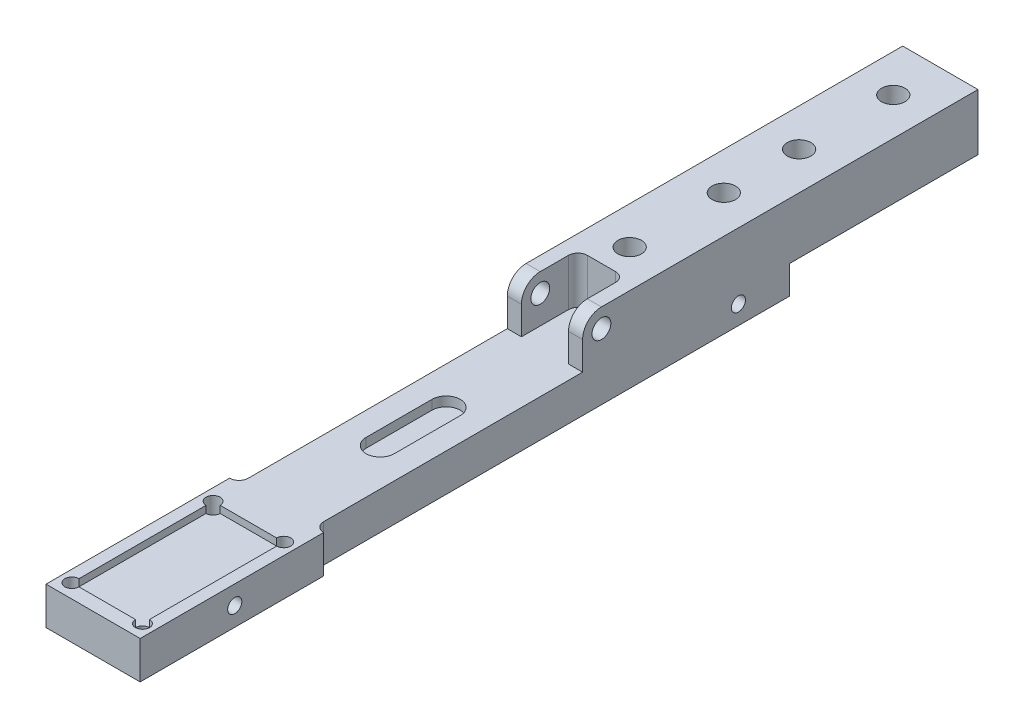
ISO-10303-21;
HEADER;
FILE_DESCRIPTION(('STEP AP214'),'2;1');
FILE_NAME('part.step','',(''),(''),'','','');
FILE_SCHEMA(('AUTOMOTIVE_DESIGN { 1 0 10303 214 1 1 1 1 }'));
ENDSEC;
DATA;
#1=APPLICATION_CONTEXT('core data for automotive mechanical design processes');
#2=APPLICATION_PROTOCOL_DEFINITION('international standard','automotive_design',2000,#1);
#3=PRODUCT_CONTEXT('',#1,'mechanical');
#4=PRODUCT('Part','Part','',(#3));
#5=PRODUCT_RELATED_PRODUCT_CATEGORY('part','',(#4));
#6=PRODUCT_DEFINITION_FORMATION('','',#4);
#7=PRODUCT_DEFINITION_CONTEXT('part definition',#1,'design');
#8=PRODUCT_DEFINITION('design','',#6,#7);
#9=PRODUCT_DEFINITION_SHAPE('','',#8);
#10=(LENGTH_UNIT() NAMED_UNIT(*) SI_UNIT(.MILLI.,.METRE.));
#11=(NAMED_UNIT(*) PLANE_ANGLE_UNIT() SI_UNIT($,.RADIAN.));
#12=(NAMED_UNIT(*) SI_UNIT($,.STERADIAN.) SOLID_ANGLE_UNIT());
#13=UNCERTAINTY_MEASURE_WITH_UNIT(LENGTH_MEASURE(1.E-05),#10,'distance_accuracy_value','');
#14=(GEOMETRIC_REPRESENTATION_CONTEXT(3) GLOBAL_UNCERTAINTY_ASSIGNED_CONTEXT((#13)) GLOBAL_UNIT_ASSIGNED_CONTEXT((#10,
#11,#12)) REPRESENTATION_CONTEXT('',''));
#15=CARTESIAN_POINT('',(0.,0.,0.));
#16=DIRECTION('',(0.,0.,1.));
#17=DIRECTION('',(1.,0.,0.));
#18=AXIS2_PLACEMENT_3D('',#15,#16,#17);
#19=CARTESIAN_POINT('',(10.,-8.,-40.));
#20=DIRECTION('',(0.,0.,1.));
#21=DIRECTION('',(1.,0.,0.));
#22=AXIS2_PLACEMENT_3D('',#19,#20,#21);
#23=PLANE('',#22);
#24=DIRECTION('',(-1.,0.,0.));
#25=VECTOR('',#24,1.);
#26=CARTESIAN_POINT('',(-8.,-8.,-40.));
#27=LINE('',#26,#25);
#28=CARTESIAN_POINT('',(8.,-8.,-40.));
#29=VERTEX_POINT('',#28);
#30=CARTESIAN_POINT('',(-8.,-8.,-40.));
#31=VERTEX_POINT('',#30);
#32=EDGE_CURVE('E345',#29,#31,#27,.T.);
#33=ORIENTED_EDGE('',*,*,#32,.F.);
#34=DIRECTION('',(0.,-1.,0.));
#35=VECTOR('',#34,1.);
#36=CARTESIAN_POINT('',(8.,-8.,-40.));
#37=LINE('',#36,#35);
#38=CARTESIAN_POINT('',(8.,-14.,-40.));
#39=VERTEX_POINT('',#38);
#40=EDGE_CURVE('E365',#29,#39,#37,.T.);
#41=ORIENTED_EDGE('',*,*,#40,.T.);
#42=DIRECTION('',(-1.,0.,0.));
#43=VECTOR('',#42,1.);
#44=CARTESIAN_POINT('',(10.,-14.,-40.));
#45=LINE('',#44,#43);
#46=CARTESIAN_POINT('',(-8.,-14.,-40.));
#47=VERTEX_POINT('',#46);
#48=EDGE_CURVE('E501',#39,#47,#45,.T.);
#49=ORIENTED_EDGE('',*,*,#48,.T.);
#50=DIRECTION('',(0.,1.,0.));
#51=VECTOR('',#50,1.);
#52=CARTESIAN_POINT('',(-8.,-8.,-40.));
#53=LINE('',#52,#51);
#54=EDGE_CURVE('E448',#47,#31,#53,.T.);
#55=ORIENTED_EDGE('',*,*,#54,.T.);
#56=EDGE_LOOP('',(#33,#41,#49,#55));
#57=FACE_BOUND('',#56,.T.);
#58=ADVANCED_FACE('F35',(#57),#23,.F.);
#59=CARTESIAN_POINT('',(10.,-8.,4.));
#60=DIRECTION('',(0.,0.,-1.));
#61=DIRECTION('',(-1.,0.,0.));
#62=AXIS2_PLACEMENT_3D('',#59,#60,#61);
#63=PLANE('',#62);
#64=DIRECTION('',(-1.,0.,0.));
#65=VECTOR('',#64,1.);
#66=CARTESIAN_POINT('',(-8.,-6.,4.));
#67=LINE('',#66,#65);
#68=CARTESIAN_POINT('',(8.,-6.,4.));
#69=VERTEX_POINT('',#68);
#70=CARTESIAN_POINT('',(5.,-6.,4.));
#71=VERTEX_POINT('',#70);
#72=EDGE_CURVE('E546',#69,#71,#67,.T.);
#73=ORIENTED_EDGE('',*,*,#72,.F.);
#74=DIRECTION('',(0.,-1.,0.));
#75=VECTOR('',#74,1.);
#76=CARTESIAN_POINT('',(8.,-8.,4.));
#77=LINE('',#76,#75);
#78=CARTESIAN_POINT('',(8.,0.,4.));
#79=VERTEX_POINT('',#78);
#80=EDGE_CURVE('E461',#79,#69,#77,.T.);
#81=ORIENTED_EDGE('',*,*,#80,.F.);
#82=DIRECTION('',(-1.,0.,0.));
#83=VECTOR('',#82,1.);
#84=CARTESIAN_POINT('',(10.,0.,4.));
#85=LINE('',#84,#83);
#86=CARTESIAN_POINT('',(5.,0.,4.));
#87=VERTEX_POINT('',#86);
#88=EDGE_CURVE('E481',#79,#87,#85,.T.);
#89=ORIENTED_EDGE('',*,*,#88,.T.);
#90=DIRECTION('',(0.,1.,0.));
#91=VECTOR('',#90,1.);
#92=CARTESIAN_POINT('',(5.,-6.,4.));
#93=LINE('',#92,#91);
#94=EDGE_CURVE('E545',#71,#87,#93,.T.);
#95=ORIENTED_EDGE('',*,*,#94,.F.);
#96=EDGE_LOOP('',(#73,#81,#89,#95));
#97=FACE_BOUND('',#96,.T.);
#98=ADVANCED_FACE('F435',(#97),#63,.F.);
#99=CARTESIAN_POINT('',(-5.,-6.,4.));
#100=VERTEX_POINT('',#99);
#101=CARTESIAN_POINT('',(-8.,-6.,4.));
#102=VERTEX_POINT('',#101);
#103=EDGE_CURVE('E597',#100,#102,#67,.T.);
#104=ORIENTED_EDGE('',*,*,#103,.F.);
#105=DIRECTION('',(0.,1.,0.));
#106=VECTOR('',#105,1.);
#107=CARTESIAN_POINT('',(-5.,-6.,4.));
#108=LINE('',#107,#106);
#109=CARTESIAN_POINT('',(-5.,0.,4.));
#110=VERTEX_POINT('',#109);
#111=EDGE_CURVE('E553',#100,#110,#108,.T.);
#112=ORIENTED_EDGE('',*,*,#111,.T.);
#113=CARTESIAN_POINT('',(-8.,0.,4.));
#114=VERTEX_POINT('',#113);
#115=EDGE_CURVE('E535',#110,#114,#85,.T.);
#116=ORIENTED_EDGE('',*,*,#115,.T.);
#117=DIRECTION('',(0.,1.,0.));
#118=VECTOR('',#117,1.);
#119=CARTESIAN_POINT('',(-8.,-8.,4.));
#120=LINE('',#119,#118);
#121=EDGE_CURVE('E482',#102,#114,#120,.T.);
#122=ORIENTED_EDGE('',*,*,#121,.F.);
#123=EDGE_LOOP('',(#104,#112,#116,#122));
#124=FACE_BOUND('',#123,.T.);
#125=ADVANCED_FACE('F442',(#124),#63,.F.);
#126=CARTESIAN_POINT('',(10.,0.,0.));
#127=DIRECTION('',(-1.,0.,0.));
#128=DIRECTION('',(0.,0.,1.));
#129=AXIS2_PLACEMENT_3D('',#126,#127,#128);
#130=CYLINDRICAL_SURFACE('',#129,4.);
#131=ORIENTED_EDGE('',*,*,#115,.F.);
#132=CARTESIAN_POINT('',(-5.,0.,0.));
#133=DIRECTION('',(-1.,0.,0.));
#134=DIRECTION('',(0.,0.,1.));
#135=AXIS2_PLACEMENT_3D('',#132,#133,#134);
#136=CIRCLE('',#135,4.);
#137=CARTESIAN_POINT('',(-5.,4.,0.));
#138=VERTEX_POINT('',#137);
#139=EDGE_CURVE('E525',#110,#138,#136,.T.);
#140=ORIENTED_EDGE('',*,*,#139,.T.);
#141=DIRECTION('',(-1.,0.,0.));
#142=VECTOR('',#141,1.);
#143=CARTESIAN_POINT('',(10.,4.,0.));
#144=LINE('',#143,#142);
#145=CARTESIAN_POINT('',(-8.,4.,0.));
#146=VERTEX_POINT('',#145);
#147=EDGE_CURVE('E490',#138,#146,#144,.T.);
#148=ORIENTED_EDGE('',*,*,#147,.T.);
#149=CARTESIAN_POINT('',(-8.,0.,0.));
#150=DIRECTION('',(1.,0.,0.));
#151=DIRECTION('',(0.,0.,-1.));
#152=AXIS2_PLACEMENT_3D('',#149,#150,#151);
#153=CIRCLE('',#152,4.);
#154=EDGE_CURVE('E513',#146,#114,#153,.T.);
#155=ORIENTED_EDGE('',*,*,#154,.T.);
#156=EDGE_LOOP('',(#131,#140,#148,#155));
#157=FACE_BOUND('',#156,.T.);
#158=ADVANCED_FACE('F640',(#157),#130,.T.);
#159=CARTESIAN_POINT('',(10.,0.,0.));
#160=DIRECTION('',(-1.,0.,0.));
#161=DIRECTION('',(0.,0.,1.));
#162=AXIS2_PLACEMENT_3D('',#159,#160,#161);
#163=CYLINDRICAL_SURFACE('',#162,2.);
#164=CARTESIAN_POINT('',(-5.,0.,0.));
#165=DIRECTION('',(-1.,0.,0.));
#166=DIRECTION('',(0.,0.,1.));
#167=AXIS2_PLACEMENT_3D('',#164,#165,#166);
#168=CIRCLE('',#167,2.);
#169=CARTESIAN_POINT('',(-5.,0.,2.));
#170=VERTEX_POINT('',#169);
#171=EDGE_CURVE('E522',#170,#170,#168,.T.);
#172=ORIENTED_EDGE('',*,*,#171,.F.);
#173=EDGE_LOOP('',(#172));
#174=FACE_BOUND('',#173,.T.);
#175=CARTESIAN_POINT('',(-8.,0.,0.));
#176=DIRECTION('',(1.,0.,0.));
#177=DIRECTION('',(0.,0.,-1.));
#178=AXIS2_PLACEMENT_3D('',#175,#176,#177);
#179=CIRCLE('',#178,2.);
#180=CARTESIAN_POINT('',(-8.,0.,-2.));
#181=VERTEX_POINT('',#180);
#182=EDGE_CURVE('E510',#181,#181,#179,.T.);
#183=ORIENTED_EDGE('',*,*,#182,.F.);
#184=EDGE_LOOP('',(#183));
#185=FACE_BOUND('',#184,.T.);
#186=ADVANCED_FACE('F669',(#174,#185),#163,.F.);
#187=CARTESIAN_POINT('',(10.,-8.00000000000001,100.));
#188=DIRECTION('',(0.,0.,-1.));
#189=DIRECTION('',(-1.,0.,0.));
#190=AXIS2_PLACEMENT_3D('',#187,#188,#189);
#191=PLANE('',#190);
#192=DIRECTION('',(0.,-1.,0.));
#193=VECTOR('',#192,1.);
#194=CARTESIAN_POINT('',(-10.,-8.00000000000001,100.));
#195=LINE('',#194,#193);
#196=CARTESIAN_POINT('',(-10.,-6.,100.));
#197=VERTEX_POINT('',#196);
#198=CARTESIAN_POINT('',(-10.,-14.,100.));
#199=VERTEX_POINT('',#198);
#200=EDGE_CURVE('E489',#197,#199,#195,.T.);
#201=ORIENTED_EDGE('',*,*,#200,.T.);
#202=DIRECTION('',(-1.,0.,0.));
#203=VECTOR('',#202,1.);
#204=CARTESIAN_POINT('',(10.,-14.,100.));
#205=LINE('',#204,#203);
#206=CARTESIAN_POINT('',(10.,-14.,100.));
#207=VERTEX_POINT('',#206);
#208=EDGE_CURVE('E506',#207,#199,#205,.T.);
#209=ORIENTED_EDGE('',*,*,#208,.F.);
#210=DIRECTION('',(0.,-1.,0.));
#211=VECTOR('',#210,1.);
#212=CARTESIAN_POINT('',(10.,-8.00000000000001,100.));
#213=LINE('',#212,#211);
#214=CARTESIAN_POINT('',(10.,-6.,100.));
#215=VERTEX_POINT('',#214);
#216=EDGE_CURVE('E497',#215,#207,#213,.T.);
#217=ORIENTED_EDGE('',*,*,#216,.F.);
#218=DIRECTION('',(-1.,0.,0.));
#219=VECTOR('',#218,1.);
#220=CARTESIAN_POINT('',(-10.,-6.,100.));
#221=LINE('',#220,#219);
#222=EDGE_CURVE('E604',#215,#197,#221,.T.);
#223=ORIENTED_EDGE('',*,*,#222,.T.);
#224=EDGE_LOOP('',(#201,#209,#217,#223));
#225=FACE_BOUND('',#224,.T.);
#226=ADVANCED_FACE('F667',(#225),#191,.F.);
#227=CARTESIAN_POINT('',(10.,-14.,-40.));
#228=DIRECTION('',(0.,1.,0.));
#229=DIRECTION('',(0.,0.,1.));
#230=AXIS2_PLACEMENT_3D('',#227,#228,#229);
#231=PLANE('',#230);
#232=CARTESIAN_POINT('',(0.,-14.,-14.));
#233=DIRECTION('',(0.,-1.,0.));
#234=DIRECTION('',(0.,0.,-1.));
#235=AXIS2_PLACEMENT_3D('',#232,#233,#234);
#236=CIRCLE('',#235,2.5);
#237=CARTESIAN_POINT('',(0.,-14.,-16.5));
#238=VERTEX_POINT('',#237);
#239=EDGE_CURVE('E809',#238,#238,#236,.T.);
#240=ORIENTED_EDGE('',*,*,#239,.F.);
#241=EDGE_LOOP('',(#240));
#242=FACE_BOUND('',#241,.T.);
#243=CARTESIAN_POINT('',(0.,-14.,-34.));
#244=DIRECTION('',(0.,-1.,0.));
#245=DIRECTION('',(0.,0.,-1.));
#246=AXIS2_PLACEMENT_3D('',#243,#244,#245);
#247=CIRCLE('',#246,2.5);
#248=CARTESIAN_POINT('',(0.,-14.,-36.5));
#249=VERTEX_POINT('',#248);
#250=EDGE_CURVE('E269',#249,#249,#247,.T.);
#251=ORIENTED_EDGE('',*,*,#250,.F.);
#252=EDGE_LOOP('',(#251));
#253=FACE_BOUND('',#252,.T.);
#254=CARTESIAN_POINT('',(-7.5,-14.,96.9999999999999));
#255=DIRECTION('',(0.,1.,0.));
#256=DIRECTION('',(0.,0.,1.));
#257=AXIS2_PLACEMENT_3D('',#254,#255,#256);
#258=CIRCLE('',#257,1.5);
#259=CARTESIAN_POINT('',(-7.5,-14.,98.4999999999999));
#260=VERTEX_POINT('',#259);
#261=EDGE_CURVE('E324',#260,#260,#258,.T.);
#262=ORIENTED_EDGE('',*,*,#261,.T.);
#263=EDGE_LOOP('',(#262));
#264=FACE_BOUND('',#263,.T.);
#265=CARTESIAN_POINT('',(-7.49999999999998,-14.,67.));
#266=DIRECTION('',(0.,1.,0.));
#267=DIRECTION('',(0.,0.,1.));
#268=AXIS2_PLACEMENT_3D('',#265,#266,#267);
#269=CIRCLE('',#268,1.5);
#270=CARTESIAN_POINT('',(-7.49999999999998,-14.,68.5));
#271=VERTEX_POINT('',#270);
#272=EDGE_CURVE('E330',#271,#271,#269,.T.);
#273=ORIENTED_EDGE('',*,*,#272,.T.);
#274=EDGE_LOOP('',(#273));
#275=FACE_BOUND('',#274,.T.);
#276=CARTESIAN_POINT('',(7.5,-14.,67.));
#277=DIRECTION('',(0.,1.,0.));
#278=DIRECTION('',(0.,0.,1.));
#279=AXIS2_PLACEMENT_3D('',#276,#277,#278);
#280=CIRCLE('',#279,1.5);
#281=CARTESIAN_POINT('',(7.5,-14.,68.5));
#282=VERTEX_POINT('',#281);
#283=EDGE_CURVE('E336',#282,#282,#280,.T.);
#284=ORIENTED_EDGE('',*,*,#283,.T.);
#285=EDGE_LOOP('',(#284));
#286=FACE_BOUND('',#285,.T.);
#287=CARTESIAN_POINT('',(7.5,-14.,97.));
#288=DIRECTION('',(0.,1.,0.));
#289=DIRECTION('',(0.,0.,1.));
#290=AXIS2_PLACEMENT_3D('',#287,#288,#289);
#291=CIRCLE('',#290,1.5);
#292=CARTESIAN_POINT('',(7.5,-14.,98.5));
#293=VERTEX_POINT('',#292);
#294=EDGE_CURVE('E342',#293,#293,#291,.T.);
#295=ORIENTED_EDGE('',*,*,#294,.T.);
#296=EDGE_LOOP('',(#295));
#297=FACE_BOUND('',#296,.T.);
#298=CARTESIAN_POINT('',(-10.,-14.,59.));
#299=DIRECTION('',(0.,1.,0.));
#300=DIRECTION('',(0.,0.,1.));
#301=AXIS2_PLACEMENT_3D('',#298,#299,#300);
#302=CIRCLE('',#301,2.);
#303=CARTESIAN_POINT('',(-9.99999999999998,-14.,61.));
#304=VERTEX_POINT('',#303);
#305=CARTESIAN_POINT('',(-8.,-14.,59.));
#306=VERTEX_POINT('',#305);
#307=EDGE_CURVE('E359',#304,#306,#302,.T.);
#308=ORIENTED_EDGE('',*,*,#307,.T.);
#309=DIRECTION('',(0.,0.,-1.));
#310=VECTOR('',#309,1.);
#311=CARTESIAN_POINT('',(-8.,-14.,-40.));
#312=LINE('',#311,#310);
#313=EDGE_CURVE('E620',#306,#47,#312,.T.);
#314=ORIENTED_EDGE('',*,*,#313,.T.);
#315=ORIENTED_EDGE('',*,*,#48,.F.);
#316=DIRECTION('',(0.,0.,1.));
#317=VECTOR('',#316,1.);
#318=CARTESIAN_POINT('',(8.,-14.,-40.));
#319=LINE('',#318,#317);
#320=CARTESIAN_POINT('',(8.,-14.,59.));
#321=VERTEX_POINT('',#320);
#322=EDGE_CURVE('E458',#39,#321,#319,.T.);
#323=ORIENTED_EDGE('',*,*,#322,.T.);
#324=CARTESIAN_POINT('',(10.,-14.,59.));
#325=DIRECTION('',(0.,1.,0.));
#326=DIRECTION('',(0.,0.,1.));
#327=AXIS2_PLACEMENT_3D('',#324,#325,#326);
#328=CIRCLE('',#327,2.);
#329=CARTESIAN_POINT('',(10.,-14.,61.));
#330=VERTEX_POINT('',#329);
#331=EDGE_CURVE('E611',#321,#330,#328,.T.);
#332=ORIENTED_EDGE('',*,*,#331,.T.);
#333=DIRECTION('',(0.,0.,-1.));
#334=VECTOR('',#333,1.);
#335=CARTESIAN_POINT('',(10.,-14.,-40.));
#336=LINE('',#335,#334);
#337=EDGE_CURVE('E499',#207,#330,#336,.T.);
#338=ORIENTED_EDGE('',*,*,#337,.F.);
#339=ORIENTED_EDGE('',*,*,#208,.T.);
#340=DIRECTION('',(0.,0.,-1.));
#341=VECTOR('',#340,1.);
#342=CARTESIAN_POINT('',(-10.,-14.,-40.));
#343=LINE('',#342,#341);
#344=EDGE_CURVE('E492',#199,#304,#343,.T.);
#345=ORIENTED_EDGE('',*,*,#344,.T.);
#346=EDGE_LOOP('',(#308,#314,#315,#323,#332,#338,#339,#345));
#347=FACE_BOUND('',#346,.T.);
#348=ADVANCED_FACE('F626',(#242,#253,#264,#275,#286,#297,#347),#231,.F.);
#349=CARTESIAN_POINT('',(10.,0.,0.));
#350=DIRECTION('',(-1.,0.,0.));
#351=DIRECTION('',(0.,0.,1.));
#352=AXIS2_PLACEMENT_3D('',#349,#350,#351);
#353=PLANE('',#352);
#354=CARTESIAN_POINT('',(10.,-10.,79.9));
#355=DIRECTION('',(1.,0.,0.));
#356=DIRECTION('',(0.,0.,-1.));
#357=AXIS2_PLACEMENT_3D('',#354,#355,#356);
#358=CIRCLE('',#357,1.5);
#359=CARTESIAN_POINT('',(10.,-10.,78.4));
#360=VERTEX_POINT('',#359);
#361=EDGE_CURVE('E789',#360,#360,#358,.T.);
#362=ORIENTED_EDGE('',*,*,#361,.F.);
#363=EDGE_LOOP('',(#362));
#364=FACE_BOUND('',#363,.T.);
#365=ORIENTED_EDGE('',*,*,#337,.T.);
#366=DIRECTION('',(0.,1.,0.));
#367=VECTOR('',#366,1.);
#368=CARTESIAN_POINT('',(10.,-14.,61.));
#369=LINE('',#368,#367);
#370=CARTESIAN_POINT('',(10.,-5.99999999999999,61.));
#371=VERTEX_POINT('',#370);
#372=EDGE_CURVE('E607',#330,#371,#369,.T.);
#373=ORIENTED_EDGE('',*,*,#372,.T.);
#374=DIRECTION('',(0.,0.,-1.));
#375=VECTOR('',#374,1.);
#376=CARTESIAN_POINT('',(10.,-6.,100.));
#377=LINE('',#376,#375);
#378=EDGE_CURVE('E598',#215,#371,#377,.T.);
#379=ORIENTED_EDGE('',*,*,#378,.F.);
#380=ORIENTED_EDGE('',*,*,#216,.T.);
#381=EDGE_LOOP('',(#365,#373,#379,#380));
#382=FACE_BOUND('',#381,.T.);
#383=ADVANCED_FACE('F663',(#364,#382),#353,.F.);
#384=CARTESIAN_POINT('',(-10.,0.,0.));
#385=DIRECTION('',(-1.,0.,0.));
#386=DIRECTION('',(0.,0.,1.));
#387=AXIS2_PLACEMENT_3D('',#384,#385,#386);
#388=PLANE('',#387);
#389=DIRECTION('',(0.,1.,0.));
#390=VECTOR('',#389,1.);
#391=CARTESIAN_POINT('',(-9.99999999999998,-14.,61.));
#392=LINE('',#391,#390);
#393=CARTESIAN_POINT('',(-9.99999999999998,-6.,61.));
#394=VERTEX_POINT('',#393);
#395=EDGE_CURVE('E618',#304,#394,#392,.T.);
#396=ORIENTED_EDGE('',*,*,#395,.F.);
#397=ORIENTED_EDGE('',*,*,#344,.F.);
#398=ORIENTED_EDGE('',*,*,#200,.F.);
#399=DIRECTION('',(0.,0.,-1.));
#400=VECTOR('',#399,1.);
#401=CARTESIAN_POINT('',(-10.,-6.,100.));
#402=LINE('',#401,#400);
#403=EDGE_CURVE('E601',#197,#394,#402,.T.);
#404=ORIENTED_EDGE('',*,*,#403,.T.);
#405=EDGE_LOOP('',(#396,#397,#398,#404));
#406=FACE_BOUND('',#405,.T.);
#407=ADVANCED_FACE('F633',(#406),#388,.T.);
#408=CARTESIAN_POINT('',(10.,4.,0.));
#409=DIRECTION('',(0.,-1.,0.));
#410=DIRECTION('',(0.,0.,-1.));
#411=AXIS2_PLACEMENT_3D('',#408,#409,#410);
#412=PLANE('',#411);
#413=CARTESIAN_POINT('',(0.,4.00000000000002,-50.));
#414=DIRECTION('',(0.,-1.,0.));
#415=DIRECTION('',(1.,0.,0.));
#416=AXIS2_PLACEMENT_3D('',#413,#414,#415);
#417=CIRCLE('',#416,2.5);
#418=CARTESIAN_POINT('',(2.50000000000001,4.00000000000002,-50.));
#419=VERTEX_POINT('',#418);
#420=EDGE_CURVE('E800',#419,#419,#417,.T.);
#421=ORIENTED_EDGE('',*,*,#420,.T.);
#422=EDGE_LOOP('',(#421));
#423=FACE_BOUND('',#422,.T.);
#424=CARTESIAN_POINT('',(0.,4.00000000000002,-70.));
#425=DIRECTION('',(0.,-1.,0.));
#426=DIRECTION('',(1.,0.,0.));
#427=AXIS2_PLACEMENT_3D('',#424,#425,#426);
#428=CIRCLE('',#427,2.5);
#429=CARTESIAN_POINT('',(2.50000000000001,4.00000000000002,-70.));
#430=VERTEX_POINT('',#429);
#431=EDGE_CURVE('E806',#430,#430,#428,.T.);
#432=ORIENTED_EDGE('',*,*,#431,.T.);
#433=EDGE_LOOP('',(#432));
#434=FACE_BOUND('',#433,.T.);
#435=CARTESIAN_POINT('',(0.,4.00000000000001,-14.));
#436=DIRECTION('',(0.,-1.,0.));
#437=DIRECTION('',(0.,0.,-1.));
#438=AXIS2_PLACEMENT_3D('',#435,#436,#437);
#439=CIRCLE('',#438,2.5);
#440=CARTESIAN_POINT('',(0.,4.00000000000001,-16.5));
#441=VERTEX_POINT('',#440);
#442=EDGE_CURVE('E812',#441,#441,#439,.T.);
#443=ORIENTED_EDGE('',*,*,#442,.T.);
#444=EDGE_LOOP('',(#443));
#445=FACE_BOUND('',#444,.T.);
#446=CARTESIAN_POINT('',(0.,4.00000000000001,-34.));
#447=DIRECTION('',(0.,-1.,0.));
#448=DIRECTION('',(0.,0.,-1.));
#449=AXIS2_PLACEMENT_3D('',#446,#447,#448);
#450=CIRCLE('',#449,2.5);
#451=CARTESIAN_POINT('',(0.,4.00000000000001,-36.5));
#452=VERTEX_POINT('',#451);
#453=EDGE_CURVE('E276',#452,#452,#450,.T.);
#454=ORIENTED_EDGE('',*,*,#453,.T.);
#455=EDGE_LOOP('',(#454));
#456=FACE_BOUND('',#455,.T.);
#457=ORIENTED_EDGE('',*,*,#147,.F.);
#458=DIRECTION('',(0.,0.,1.));
#459=VECTOR('',#458,1.);
#460=CARTESIAN_POINT('',(-5.,4.,4.));
#461=LINE('',#460,#459);
#462=CARTESIAN_POINT('',(-5.,4.,-6.));
#463=VERTEX_POINT('',#462);
#464=EDGE_CURVE('E576',#463,#138,#461,.T.);
#465=ORIENTED_EDGE('',*,*,#464,.F.);
#466=CARTESIAN_POINT('',(-3.,4.,-6.));
#467=DIRECTION('',(0.,1.,0.));
#468=DIRECTION('',(0.,0.,-1.));
#469=AXIS2_PLACEMENT_3D('',#466,#467,#468);
#470=CIRCLE('',#469,2.);
#471=CARTESIAN_POINT('',(-3.,4.,-8.));
#472=VERTEX_POINT('',#471);
#473=EDGE_CURVE('E565',#472,#463,#470,.T.);
#474=ORIENTED_EDGE('',*,*,#473,.F.);
#475=DIRECTION('',(-1.,0.,0.));
#476=VECTOR('',#475,1.);
#477=CARTESIAN_POINT('',(-3.,4.,-8.));
#478=LINE('',#477,#476);
#479=CARTESIAN_POINT('',(3.,4.,-8.));
#480=VERTEX_POINT('',#479);
#481=EDGE_CURVE('E569',#480,#472,#478,.T.);
#482=ORIENTED_EDGE('',*,*,#481,.F.);
#483=CARTESIAN_POINT('',(3.,4.,-6.));
#484=DIRECTION('',(0.,1.,0.));
#485=DIRECTION('',(0.,0.,1.));
#486=AXIS2_PLACEMENT_3D('',#483,#484,#485);
#487=CIRCLE('',#486,2.);
#488=CARTESIAN_POINT('',(5.,4.,-6.));
#489=VERTEX_POINT('',#488);
#490=EDGE_CURVE('E572',#489,#480,#487,.T.);
#491=ORIENTED_EDGE('',*,*,#490,.F.);
#492=DIRECTION('',(0.,0.,-1.));
#493=VECTOR('',#492,1.);
#494=CARTESIAN_POINT('',(5.,4.,4.));
#495=LINE('',#494,#493);
#496=CARTESIAN_POINT('',(5.,4.,0.));
#497=VERTEX_POINT('',#496);
#498=EDGE_CURVE('E488',#497,#489,#495,.T.);
#499=ORIENTED_EDGE('',*,*,#498,.F.);
#500=CARTESIAN_POINT('',(8.,4.,0.));
#501=VERTEX_POINT('',#500);
#502=EDGE_CURVE('E479',#501,#497,#144,.T.);
#503=ORIENTED_EDGE('',*,*,#502,.F.);
#504=DIRECTION('',(0.,0.,1.));
#505=VECTOR('',#504,1.);
#506=CARTESIAN_POINT('',(8.,4.,-40.));
#507=LINE('',#506,#505);
#508=CARTESIAN_POINT('',(8.,4.,-80.));
#509=VERTEX_POINT('',#508);
#510=EDGE_CURVE('E460',#509,#501,#507,.T.);
#511=ORIENTED_EDGE('',*,*,#510,.F.);
#512=DIRECTION('',(1.,0.,0.));
#513=VECTOR('',#512,1.);
#514=CARTESIAN_POINT('',(-8.,4.,-80.));
#515=LINE('',#514,#513);
#516=CARTESIAN_POINT('',(-8.,4.,-80.));
#517=VERTEX_POINT('',#516);
#518=EDGE_CURVE('E349',#517,#509,#515,.T.);
#519=ORIENTED_EDGE('',*,*,#518,.F.);
#520=DIRECTION('',(0.,0.,1.));
#521=VECTOR('',#520,1.);
#522=CARTESIAN_POINT('',(-8.,4.,-40.));
#523=LINE('',#522,#521);
#524=EDGE_CURVE('E514',#517,#146,#523,.T.);
#525=ORIENTED_EDGE('',*,*,#524,.T.);
#526=EDGE_LOOP('',(#457,#465,#474,#482,#491,#499,#503,#511,#519,#525));
#527=FACE_BOUND('',#526,.T.);
#528=ADVANCED_FACE('F486',(#423,#434,#445,#456,#527),#412,.F.);
#529=ORIENTED_EDGE('',*,*,#502,.T.);
#530=CARTESIAN_POINT('',(5.,0.,0.));
#531=DIRECTION('',(1.,0.,0.));
#532=DIRECTION('',(0.,0.,-1.));
#533=AXIS2_PLACEMENT_3D('',#530,#531,#532);
#534=CIRCLE('',#533,4.);
#535=EDGE_CURVE('E520',#497,#87,#534,.T.);
#536=ORIENTED_EDGE('',*,*,#535,.T.);
#537=ORIENTED_EDGE('',*,*,#88,.F.);
#538=CARTESIAN_POINT('',(8.,0.,0.));
#539=DIRECTION('',(-1.,0.,0.));
#540=DIRECTION('',(0.,0.,1.));
#541=AXIS2_PLACEMENT_3D('',#538,#539,#540);
#542=CIRCLE('',#541,4.);
#543=EDGE_CURVE('E468',#79,#501,#542,.T.);
#544=ORIENTED_EDGE('',*,*,#543,.T.);
#545=EDGE_LOOP('',(#529,#536,#537,#544));
#546=FACE_BOUND('',#545,.T.);
#547=ADVANCED_FACE('F477',(#546),#130,.T.);
#548=CARTESIAN_POINT('',(5.,0.,0.));
#549=DIRECTION('',(1.,0.,0.));
#550=DIRECTION('',(0.,0.,-1.));
#551=AXIS2_PLACEMENT_3D('',#548,#549,#550);
#552=CIRCLE('',#551,2.);
#553=CARTESIAN_POINT('',(5.,0.,-2.));
#554=VERTEX_POINT('',#553);
#555=EDGE_CURVE('E517',#554,#554,#552,.T.);
#556=ORIENTED_EDGE('',*,*,#555,.F.);
#557=EDGE_LOOP('',(#556));
#558=FACE_BOUND('',#557,.T.);
#559=CARTESIAN_POINT('',(8.,0.,0.));
#560=DIRECTION('',(-1.,0.,0.));
#561=DIRECTION('',(0.,0.,1.));
#562=AXIS2_PLACEMENT_3D('',#559,#560,#561);
#563=CIRCLE('',#562,2.);
#564=CARTESIAN_POINT('',(8.,0.,2.));
#565=VERTEX_POINT('',#564);
#566=EDGE_CURVE('E472',#565,#565,#563,.T.);
#567=ORIENTED_EDGE('',*,*,#566,.F.);
#568=EDGE_LOOP('',(#567));
#569=FACE_BOUND('',#568,.T.);
#570=ADVANCED_FACE('F680',(#558,#569),#163,.F.);
#571=CARTESIAN_POINT('',(-8.,-8.,-40.));
#572=DIRECTION('',(1.,0.,0.));
#573=DIRECTION('',(0.,0.,-1.));
#574=AXIS2_PLACEMENT_3D('',#571,#572,#573);
#575=PLANE('',#574);
#576=ORIENTED_EDGE('',*,*,#182,.T.);
#577=EDGE_LOOP('',(#576));
#578=FACE_BOUND('',#577,.T.);
#579=ORIENTED_EDGE('',*,*,#524,.F.);
#580=DIRECTION('',(0.,1.,0.));
#581=VECTOR('',#580,1.);
#582=CARTESIAN_POINT('',(-8.,4.,-80.));
#583=LINE('',#582,#581);
#584=CARTESIAN_POINT('',(-8.,-8.,-80.));
#585=VERTEX_POINT('',#584);
#586=EDGE_CURVE('E346',#585,#517,#583,.T.);
#587=ORIENTED_EDGE('',*,*,#586,.F.);
#588=DIRECTION('',(0.,0.,1.));
#589=VECTOR('',#588,1.);
#590=CARTESIAN_POINT('',(-8.,-8.,-80.));
#591=LINE('',#590,#589);
#592=EDGE_CURVE('E356',#585,#31,#591,.T.);
#593=ORIENTED_EDGE('',*,*,#592,.T.);
#594=ORIENTED_EDGE('',*,*,#54,.F.);
#595=ORIENTED_EDGE('',*,*,#313,.F.);
#596=DIRECTION('',(0.,1.,0.));
#597=VECTOR('',#596,1.);
#598=CARTESIAN_POINT('',(-8.,-14.,59.));
#599=LINE('',#598,#597);
#600=CARTESIAN_POINT('',(-8.,-5.99999999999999,59.));
#601=VERTEX_POINT('',#600);
#602=EDGE_CURVE('E617',#306,#601,#599,.T.);
#603=ORIENTED_EDGE('',*,*,#602,.T.);
#604=DIRECTION('',(0.,0.,-1.));
#605=VECTOR('',#604,1.);
#606=CARTESIAN_POINT('',(-8.,-6.,19.));
#607=LINE('',#606,#605);
#608=EDGE_CURVE('E593',#601,#102,#607,.T.);
#609=ORIENTED_EDGE('',*,*,#608,.T.);
#610=ORIENTED_EDGE('',*,*,#121,.T.);
#611=ORIENTED_EDGE('',*,*,#154,.F.);
#612=EDGE_LOOP('',(#579,#587,#593,#594,#595,#603,#609,#610,#611));
#613=FACE_BOUND('',#612,.T.);
#614=ADVANCED_FACE('F637',(#578,#613),#575,.F.);
#615=CARTESIAN_POINT('',(8.,-8.,-40.));
#616=DIRECTION('',(-1.,0.,0.));
#617=DIRECTION('',(0.,0.,1.));
#618=AXIS2_PLACEMENT_3D('',#615,#616,#617);
#619=PLANE('',#618);
#620=CARTESIAN_POINT('',(8.,-10.,-29.1));
#621=DIRECTION('',(1.,0.,0.));
#622=DIRECTION('',(0.,0.,-1.));
#623=AXIS2_PLACEMENT_3D('',#620,#621,#622);
#624=CIRCLE('',#623,1.5);
#625=CARTESIAN_POINT('',(8.,-10.,-30.6));
#626=VERTEX_POINT('',#625);
#627=EDGE_CURVE('E788',#626,#626,#624,.T.);
#628=ORIENTED_EDGE('',*,*,#627,.F.);
#629=EDGE_LOOP('',(#628));
#630=FACE_BOUND('',#629,.T.);
#631=ORIENTED_EDGE('',*,*,#566,.T.);
#632=EDGE_LOOP('',(#631));
#633=FACE_BOUND('',#632,.T.);
#634=ORIENTED_EDGE('',*,*,#80,.T.);
#635=DIRECTION('',(0.,0.,-1.));
#636=VECTOR('',#635,1.);
#637=CARTESIAN_POINT('',(8.,-6.,19.));
#638=LINE('',#637,#636);
#639=CARTESIAN_POINT('',(8.,-6.,59.));
#640=VERTEX_POINT('',#639);
#641=EDGE_CURVE('E578',#640,#69,#638,.T.);
#642=ORIENTED_EDGE('',*,*,#641,.F.);
#643=DIRECTION('',(0.,1.,0.));
#644=VECTOR('',#643,1.);
#645=CARTESIAN_POINT('',(8.,-14.,59.));
#646=LINE('',#645,#644);
#647=EDGE_CURVE('E608',#321,#640,#646,.T.);
#648=ORIENTED_EDGE('',*,*,#647,.F.);
#649=ORIENTED_EDGE('',*,*,#322,.F.);
#650=ORIENTED_EDGE('',*,*,#40,.F.);
#651=DIRECTION('',(0.,0.,1.));
#652=VECTOR('',#651,1.);
#653=CARTESIAN_POINT('',(8.,-8.,-80.));
#654=LINE('',#653,#652);
#655=CARTESIAN_POINT('',(8.,-8.,-80.));
#656=VERTEX_POINT('',#655);
#657=EDGE_CURVE('E370',#656,#29,#654,.T.);
#658=ORIENTED_EDGE('',*,*,#657,.F.);
#659=DIRECTION('',(0.,-1.,0.));
#660=VECTOR('',#659,1.);
#661=CARTESIAN_POINT('',(8.,4.,-80.));
#662=LINE('',#661,#660);
#663=EDGE_CURVE('E352',#509,#656,#662,.T.);
#664=ORIENTED_EDGE('',*,*,#663,.F.);
#665=ORIENTED_EDGE('',*,*,#510,.T.);
#666=ORIENTED_EDGE('',*,*,#543,.F.);
#667=EDGE_LOOP('',(#634,#642,#648,#649,#650,#658,#664,#665,#666));
#668=FACE_BOUND('',#667,.T.);
#669=ADVANCED_FACE('F454',(#630,#633,#668),#619,.F.);
#670=CARTESIAN_POINT('',(-5.,-6.,4.));
#671=DIRECTION('',(-1.,0.,0.));
#672=DIRECTION('',(0.,0.,1.));
#673=AXIS2_PLACEMENT_3D('',#670,#671,#672);
#674=PLANE('',#673);
#675=ORIENTED_EDGE('',*,*,#171,.T.);
#676=EDGE_LOOP('',(#675));
#677=FACE_BOUND('',#676,.T.);
#678=ORIENTED_EDGE('',*,*,#111,.F.);
#679=DIRECTION('',(0.,0.,1.));
#680=VECTOR('',#679,1.);
#681=CARTESIAN_POINT('',(-5.,-6.,4.));
#682=LINE('',#681,#680);
#683=CARTESIAN_POINT('',(-5.,-6.,-6.));
#684=VERTEX_POINT('',#683);
#685=EDGE_CURVE('E568',#684,#100,#682,.T.);
#686=ORIENTED_EDGE('',*,*,#685,.F.);
#687=DIRECTION('',(0.,1.,0.));
#688=VECTOR('',#687,1.);
#689=CARTESIAN_POINT('',(-5.,-6.,-6.));
#690=LINE('',#689,#688);
#691=EDGE_CURVE('E521',#684,#463,#690,.T.);
#692=ORIENTED_EDGE('',*,*,#691,.T.);
#693=ORIENTED_EDGE('',*,*,#464,.T.);
#694=ORIENTED_EDGE('',*,*,#139,.F.);
#695=EDGE_LOOP('',(#678,#686,#692,#693,#694));
#696=FACE_BOUND('',#695,.T.);
#697=ADVANCED_FACE('F643',(#677,#696),#674,.F.);
#698=CARTESIAN_POINT('',(5.,-6.,4.));
#699=DIRECTION('',(1.,0.,0.));
#700=DIRECTION('',(0.,0.,-1.));
#701=AXIS2_PLACEMENT_3D('',#698,#699,#700);
#702=PLANE('',#701);
#703=ORIENTED_EDGE('',*,*,#555,.T.);
#704=EDGE_LOOP('',(#703));
#705=FACE_BOUND('',#704,.T.);
#706=ORIENTED_EDGE('',*,*,#498,.T.);
#707=DIRECTION('',(0.,1.,0.));
#708=VECTOR('',#707,1.);
#709=CARTESIAN_POINT('',(5.,-6.,-6.));
#710=LINE('',#709,#708);
#711=CARTESIAN_POINT('',(5.,-6.,-6.));
#712=VERTEX_POINT('',#711);
#713=EDGE_CURVE('E557',#712,#489,#710,.T.);
#714=ORIENTED_EDGE('',*,*,#713,.F.);
#715=DIRECTION('',(0.,0.,-1.));
#716=VECTOR('',#715,1.);
#717=CARTESIAN_POINT('',(5.,-6.,4.));
#718=LINE('',#717,#716);
#719=EDGE_CURVE('E587',#71,#712,#718,.T.);
#720=ORIENTED_EDGE('',*,*,#719,.F.);
#721=ORIENTED_EDGE('',*,*,#94,.T.);
#722=ORIENTED_EDGE('',*,*,#535,.F.);
#723=EDGE_LOOP('',(#706,#714,#720,#721,#722));
#724=FACE_BOUND('',#723,.T.);
#725=ADVANCED_FACE('F657',(#705,#724),#702,.F.);
#726=CARTESIAN_POINT('',(-3.,-6.,-6.));
#727=DIRECTION('',(0.,1.,0.));
#728=DIRECTION('',(0.,0.,1.));
#729=AXIS2_PLACEMENT_3D('',#726,#727,#728);
#730=CYLINDRICAL_SURFACE('',#729,2.);
#731=ORIENTED_EDGE('',*,*,#473,.T.);
#732=ORIENTED_EDGE('',*,*,#691,.F.);
#733=CARTESIAN_POINT('',(-3.,-6.,-6.));
#734=DIRECTION('',(0.,1.,0.));
#735=DIRECTION('',(0.,0.,-1.));
#736=AXIS2_PLACEMENT_3D('',#733,#734,#735);
#737=CIRCLE('',#736,2.);
#738=CARTESIAN_POINT('',(-3.,-6.,-8.));
#739=VERTEX_POINT('',#738);
#740=EDGE_CURVE('E555',#739,#684,#737,.T.);
#741=ORIENTED_EDGE('',*,*,#740,.F.);
#742=DIRECTION('',(0.,1.,0.));
#743=VECTOR('',#742,1.);
#744=CARTESIAN_POINT('',(-3.,-6.,-8.));
#745=LINE('',#744,#743);
#746=EDGE_CURVE('E562',#739,#472,#745,.T.);
#747=ORIENTED_EDGE('',*,*,#746,.T.);
#748=EDGE_LOOP('',(#731,#732,#741,#747));
#749=FACE_BOUND('',#748,.T.);
#750=ADVANCED_FACE('F647',(#749),#730,.F.);
#751=CARTESIAN_POINT('',(-3.,-6.,-8.));
#752=DIRECTION('',(0.,0.,-1.));
#753=DIRECTION('',(0.,1.,0.));
#754=AXIS2_PLACEMENT_3D('',#751,#752,#753);
#755=PLANE('',#754);
#756=ORIENTED_EDGE('',*,*,#481,.T.);
#757=ORIENTED_EDGE('',*,*,#746,.F.);
#758=DIRECTION('',(-1.,0.,0.));
#759=VECTOR('',#758,1.);
#760=CARTESIAN_POINT('',(-3.,-6.,-8.));
#761=LINE('',#760,#759);
#762=CARTESIAN_POINT('',(3.,-6.,-8.));
#763=VERTEX_POINT('',#762);
#764=EDGE_CURVE('E581',#763,#739,#761,.T.);
#765=ORIENTED_EDGE('',*,*,#764,.F.);
#766=DIRECTION('',(0.,1.,0.));
#767=VECTOR('',#766,1.);
#768=CARTESIAN_POINT('',(3.,-6.,-8.));
#769=LINE('',#768,#767);
#770=EDGE_CURVE('E560',#763,#480,#769,.T.);
#771=ORIENTED_EDGE('',*,*,#770,.T.);
#772=EDGE_LOOP('',(#756,#757,#765,#771));
#773=FACE_BOUND('',#772,.T.);
#774=ADVANCED_FACE('F650',(#773),#755,.F.);
#775=CARTESIAN_POINT('',(3.,-6.,-6.));
#776=DIRECTION('',(0.,1.,0.));
#777=DIRECTION('',(0.,0.,1.));
#778=AXIS2_PLACEMENT_3D('',#775,#776,#777);
#779=CYLINDRICAL_SURFACE('',#778,2.);
#780=ORIENTED_EDGE('',*,*,#490,.T.);
#781=ORIENTED_EDGE('',*,*,#770,.F.);
#782=CARTESIAN_POINT('',(3.,-6.,-6.));
#783=DIRECTION('',(0.,1.,0.));
#784=DIRECTION('',(0.,0.,1.));
#785=AXIS2_PLACEMENT_3D('',#782,#783,#784);
#786=CIRCLE('',#785,2.);
#787=EDGE_CURVE('E584',#712,#763,#786,.T.);
#788=ORIENTED_EDGE('',*,*,#787,.F.);
#789=ORIENTED_EDGE('',*,*,#713,.T.);
#790=EDGE_LOOP('',(#780,#781,#788,#789));
#791=FACE_BOUND('',#790,.T.);
#792=ADVANCED_FACE('F654',(#791),#779,.F.);
#793=CARTESIAN_POINT('',(-3.,-6.,-6.));
#794=DIRECTION('',(0.,-1.,0.));
#795=DIRECTION('',(0.,0.,-1.));
#796=AXIS2_PLACEMENT_3D('',#793,#794,#795);
#797=PLANE('',#796);
#798=DIRECTION('',(0.,0.,1.));
#799=VECTOR('',#798,1.);
#800=CARTESIAN_POINT('',(-3.,-6.,25.));
#801=LINE('',#800,#799);
#802=CARTESIAN_POINT('',(-3.,-6.,25.));
#803=VERTEX_POINT('',#802);
#804=CARTESIAN_POINT('',(-3.,-6.,39.));
#805=VERTEX_POINT('',#804);
#806=EDGE_CURVE('E275',#803,#805,#801,.T.);
#807=ORIENTED_EDGE('',*,*,#806,.F.);
#808=CARTESIAN_POINT('',(0.,-6.,25.));
#809=DIRECTION('',(0.,1.,0.));
#810=DIRECTION('',(0.,0.,1.));
#811=AXIS2_PLACEMENT_3D('',#808,#809,#810);
#812=CIRCLE('',#811,3.);
#813=CARTESIAN_POINT('',(3.,-6.,25.));
#814=VERTEX_POINT('',#813);
#815=EDGE_CURVE('E49',#814,#803,#812,.T.);
#816=ORIENTED_EDGE('',*,*,#815,.F.);
#817=DIRECTION('',(0.,0.,-1.));
#818=VECTOR('',#817,1.);
#819=CARTESIAN_POINT('',(3.,-6.,25.));
#820=LINE('',#819,#818);
#821=CARTESIAN_POINT('',(3.00000000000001,-6.,39.));
#822=VERTEX_POINT('',#821);
#823=EDGE_CURVE('E263',#822,#814,#820,.T.);
#824=ORIENTED_EDGE('',*,*,#823,.F.);
#825=CARTESIAN_POINT('',(0.,-6.,39.));
#826=DIRECTION('',(0.,1.,0.));
#827=DIRECTION('',(0.,0.,1.));
#828=AXIS2_PLACEMENT_3D('',#825,#826,#827);
#829=CIRCLE('',#828,3.);
#830=EDGE_CURVE('E266',#805,#822,#829,.T.);
#831=ORIENTED_EDGE('',*,*,#830,.F.);
#832=EDGE_LOOP('',(#807,#816,#824,#831));
#833=FACE_BOUND('',#832,.T.);
#834=CARTESIAN_POINT('',(-7.5,-5.99999999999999,96.9999999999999));
#835=DIRECTION('',(0.,1.,0.));
#836=DIRECTION('',(0.,0.,-1.));
#837=AXIS2_PLACEMENT_3D('',#834,#835,#836);
#838=CIRCLE('',#837,1.5);
#839=CARTESIAN_POINT('',(-7.5,-5.99999999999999,95.4999999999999));
#840=VERTEX_POINT('',#839);
#841=CARTESIAN_POINT('',(-6.,-5.99999999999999,97.));
#842=VERTEX_POINT('',#841);
#843=EDGE_CURVE('E321',#840,#842,#838,.T.);
#844=ORIENTED_EDGE('',*,*,#843,.F.);
#845=DIRECTION('',(0.,0.,1.));
#846=VECTOR('',#845,1.);
#847=CARTESIAN_POINT('',(-7.49999999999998,-5.99999999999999,67.));
#848=LINE('',#847,#846);
#849=CARTESIAN_POINT('',(-7.49999999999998,-5.99999999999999,68.5));
#850=VERTEX_POINT('',#849);
#851=EDGE_CURVE('E282',#850,#840,#848,.T.);
#852=ORIENTED_EDGE('',*,*,#851,.F.);
#853=CARTESIAN_POINT('',(-7.49999999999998,-5.99999999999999,67.));
#854=DIRECTION('',(0.,1.,0.));
#855=DIRECTION('',(0.,0.,-1.));
#856=AXIS2_PLACEMENT_3D('',#853,#854,#855);
#857=CIRCLE('',#856,1.5);
#858=CARTESIAN_POINT('',(-5.99999999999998,-5.99999999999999,67.));
#859=VERTEX_POINT('',#858);
#860=EDGE_CURVE('E327',#859,#850,#857,.T.);
#861=ORIENTED_EDGE('',*,*,#860,.F.);
#862=DIRECTION('',(-1.,0.,0.));
#863=VECTOR('',#862,1.);
#864=CARTESIAN_POINT('',(-7.49999999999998,-5.99999999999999,67.));
#865=LINE('',#864,#863);
#866=CARTESIAN_POINT('',(6.,-5.99999999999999,67.));
#867=VERTEX_POINT('',#866);
#868=EDGE_CURVE('E288',#867,#859,#865,.T.);
#869=ORIENTED_EDGE('',*,*,#868,.F.);
#870=CARTESIAN_POINT('',(7.5,-5.99999999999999,67.));
#871=DIRECTION('',(0.,1.,0.));
#872=DIRECTION('',(0.,0.,1.));
#873=AXIS2_PLACEMENT_3D('',#870,#871,#872);
#874=CIRCLE('',#873,1.5);
#875=CARTESIAN_POINT('',(7.5,-5.99999999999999,68.5));
#876=VERTEX_POINT('',#875);
#877=EDGE_CURVE('E333',#876,#867,#874,.T.);
#878=ORIENTED_EDGE('',*,*,#877,.F.);
#879=DIRECTION('',(0.,0.,-1.));
#880=VECTOR('',#879,1.);
#881=CARTESIAN_POINT('',(7.5,-5.99999999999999,67.));
#882=LINE('',#881,#880);
#883=CARTESIAN_POINT('',(7.5,-5.99999999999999,95.5));
#884=VERTEX_POINT('',#883);
#885=EDGE_CURVE('E301',#884,#876,#882,.T.);
#886=ORIENTED_EDGE('',*,*,#885,.F.);
#887=CARTESIAN_POINT('',(7.5,-5.99999999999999,97.));
#888=DIRECTION('',(0.,1.,0.));
#889=DIRECTION('',(0.,0.,1.));
#890=AXIS2_PLACEMENT_3D('',#887,#888,#889);
#891=CIRCLE('',#890,1.5);
#892=CARTESIAN_POINT('',(6.,-5.99999999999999,97.));
#893=VERTEX_POINT('',#892);
#894=EDGE_CURVE('E339',#893,#884,#891,.T.);
#895=ORIENTED_EDGE('',*,*,#894,.F.);
#896=DIRECTION('',(1.,0.,0.));
#897=VECTOR('',#896,1.);
#898=CARTESIAN_POINT('',(-7.5,-5.99999999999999,97.));
#899=LINE('',#898,#897);
#900=EDGE_CURVE('E299',#842,#893,#899,.T.);
#901=ORIENTED_EDGE('',*,*,#900,.F.);
#902=EDGE_LOOP('',(#844,#852,#861,#869,#878,#886,#895,#901));
#903=FACE_BOUND('',#902,.T.);
#904=ORIENTED_EDGE('',*,*,#608,.F.);
#905=CARTESIAN_POINT('',(-10.,-5.99999999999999,59.));
#906=DIRECTION('',(0.,-1.,0.));
#907=DIRECTION('',(0.,0.,-1.));
#908=AXIS2_PLACEMENT_3D('',#905,#906,#907);
#909=CIRCLE('',#908,2.);
#910=EDGE_CURVE('E380',#601,#394,#909,.T.);
#911=ORIENTED_EDGE('',*,*,#910,.T.);
#912=ORIENTED_EDGE('',*,*,#403,.F.);
#913=ORIENTED_EDGE('',*,*,#222,.F.);
#914=ORIENTED_EDGE('',*,*,#378,.T.);
#915=CARTESIAN_POINT('',(10.,-5.99999999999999,59.));
#916=DIRECTION('',(0.,-1.,0.));
#917=DIRECTION('',(0.,0.,-1.));
#918=AXIS2_PLACEMENT_3D('',#915,#916,#917);
#919=CIRCLE('',#918,2.);
#920=EDGE_CURVE('E509',#371,#640,#919,.T.);
#921=ORIENTED_EDGE('',*,*,#920,.T.);
#922=ORIENTED_EDGE('',*,*,#641,.T.);
#923=ORIENTED_EDGE('',*,*,#72,.T.);
#924=ORIENTED_EDGE('',*,*,#719,.T.);
#925=ORIENTED_EDGE('',*,*,#787,.T.);
#926=ORIENTED_EDGE('',*,*,#764,.T.);
#927=ORIENTED_EDGE('',*,*,#740,.T.);
#928=ORIENTED_EDGE('',*,*,#685,.T.);
#929=ORIENTED_EDGE('',*,*,#103,.T.);
#930=EDGE_LOOP('',(#904,#911,#912,#913,#914,#921,#922,#923,#924,#925,#926,#927,#928,#929));
#931=FACE_BOUND('',#930,.T.);
#932=ADVANCED_FACE('F397',(#833,#903,#931),#797,.F.);
#933=CARTESIAN_POINT('',(10.,-14.,59.));
#934=DIRECTION('',(0.,1.,0.));
#935=DIRECTION('',(0.,0.,1.));
#936=AXIS2_PLACEMENT_3D('',#933,#934,#935);
#937=CYLINDRICAL_SURFACE('',#936,2.);
#938=ORIENTED_EDGE('',*,*,#372,.F.);
#939=ORIENTED_EDGE('',*,*,#331,.F.);
#940=ORIENTED_EDGE('',*,*,#647,.T.);
#941=ORIENTED_EDGE('',*,*,#920,.F.);
#942=EDGE_LOOP('',(#938,#939,#940,#941));
#943=FACE_BOUND('',#942,.T.);
#944=ADVANCED_FACE('F660',(#943),#937,.F.);
#945=CARTESIAN_POINT('',(-10.,-14.,59.));
#946=DIRECTION('',(0.,1.,0.));
#947=DIRECTION('',(0.,0.,1.));
#948=AXIS2_PLACEMENT_3D('',#945,#946,#947);
#949=CYLINDRICAL_SURFACE('',#948,2.);
#950=ORIENTED_EDGE('',*,*,#602,.F.);
#951=ORIENTED_EDGE('',*,*,#307,.F.);
#952=ORIENTED_EDGE('',*,*,#395,.T.);
#953=ORIENTED_EDGE('',*,*,#910,.F.);
#954=EDGE_LOOP('',(#950,#951,#952,#953));
#955=FACE_BOUND('',#954,.T.);
#956=ADVANCED_FACE('F630',(#955),#949,.F.);
#957=CARTESIAN_POINT('',(-8.,-8.,-80.));
#958=DIRECTION('',(0.,1.,0.));
#959=DIRECTION('',(-1.,0.,0.));
#960=AXIS2_PLACEMENT_3D('',#957,#958,#959);
#961=PLANE('',#960);
#962=CARTESIAN_POINT('',(0.,-8.,-50.));
#963=DIRECTION('',(0.,-1.,0.));
#964=DIRECTION('',(1.,0.,0.));
#965=AXIS2_PLACEMENT_3D('',#962,#963,#964);
#966=CIRCLE('',#965,2.5);
#967=CARTESIAN_POINT('',(2.50000000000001,-8.,-50.));
#968=VERTEX_POINT('',#967);
#969=EDGE_CURVE('E798',#968,#968,#966,.T.);
#970=ORIENTED_EDGE('',*,*,#969,.F.);
#971=EDGE_LOOP('',(#970));
#972=FACE_BOUND('',#971,.T.);
#973=CARTESIAN_POINT('',(0.,-8.,-70.));
#974=DIRECTION('',(0.,-1.,0.));
#975=DIRECTION('',(1.,0.,0.));
#976=AXIS2_PLACEMENT_3D('',#973,#974,#975);
#977=CIRCLE('',#976,2.5);
#978=CARTESIAN_POINT('',(2.50000000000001,-8.,-70.));
#979=VERTEX_POINT('',#978);
#980=EDGE_CURVE('E803',#979,#979,#977,.T.);
#981=ORIENTED_EDGE('',*,*,#980,.F.);
#982=EDGE_LOOP('',(#981));
#983=FACE_BOUND('',#982,.T.);
#984=ORIENTED_EDGE('',*,*,#32,.T.);
#985=ORIENTED_EDGE('',*,*,#592,.F.);
#986=DIRECTION('',(-1.,0.,0.));
#987=VECTOR('',#986,1.);
#988=CARTESIAN_POINT('',(-8.,-8.,-80.));
#989=LINE('',#988,#987);
#990=EDGE_CURVE('E354',#656,#585,#989,.T.);
#991=ORIENTED_EDGE('',*,*,#990,.F.);
#992=ORIENTED_EDGE('',*,*,#657,.T.);
#993=EDGE_LOOP('',(#984,#985,#991,#992));
#994=FACE_BOUND('',#993,.T.);
#995=ADVANCED_FACE('F462',(#972,#983,#994),#961,.F.);
#996=CARTESIAN_POINT('',(0.,0.,-80.));
#997=DIRECTION('',(0.,0.,1.));
#998=DIRECTION('',(1.,0.,0.));
#999=AXIS2_PLACEMENT_3D('',#996,#997,#998);
#1000=PLANE('',#999);
#1001=ORIENTED_EDGE('',*,*,#586,.T.);
#1002=ORIENTED_EDGE('',*,*,#518,.T.);
#1003=ORIENTED_EDGE('',*,*,#663,.T.);
#1004=ORIENTED_EDGE('',*,*,#990,.T.);
#1005=EDGE_LOOP('',(#1001,#1002,#1003,#1004));
#1006=FACE_BOUND('',#1005,.T.);
#1007=ADVANCED_FACE('F465',(#1006),#1000,.F.);
#1008=CARTESIAN_POINT('',(7.5,-14.000025,97.));
#1009=DIRECTION('',(0.,1.,0.));
#1010=DIRECTION('',(0.,0.,1.));
#1011=AXIS2_PLACEMENT_3D('',#1008,#1009,#1010);
#1012=CYLINDRICAL_SURFACE('',#1011,1.5);
#1013=ORIENTED_EDGE('',*,*,#894,.T.);
#1014=DIRECTION('',(0.,1.,0.));
#1015=VECTOR('',#1014,1.);
#1016=CARTESIAN_POINT('',(7.5,-14.000025,95.5));
#1017=LINE('',#1016,#1015);
#1018=CARTESIAN_POINT('',(7.5,-7.49999999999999,95.5));
#1019=VERTEX_POINT('',#1018);
#1020=EDGE_CURVE('E318',#884,#1019,#1017,.F.);
#1021=ORIENTED_EDGE('',*,*,#1020,.T.);
#1022=CARTESIAN_POINT('',(7.5,-7.49999999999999,97.));
#1023=DIRECTION('',(0.,1.,0.));
#1024=DIRECTION('',(0.,0.,1.));
#1025=AXIS2_PLACEMENT_3D('',#1022,#1023,#1024);
#1026=CIRCLE('',#1025,1.5);
#1027=CARTESIAN_POINT('',(6.,-7.49999999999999,97.));
#1028=VERTEX_POINT('',#1027);
#1029=EDGE_CURVE('E307',#1028,#1019,#1026,.F.);
#1030=ORIENTED_EDGE('',*,*,#1029,.F.);
#1031=DIRECTION('',(0.,1.,0.));
#1032=VECTOR('',#1031,1.);
#1033=CARTESIAN_POINT('',(6.,-14.000025,97.));
#1034=LINE('',#1033,#1032);
#1035=EDGE_CURVE('E309',#1028,#893,#1034,.T.);
#1036=ORIENTED_EDGE('',*,*,#1035,.T.);
#1037=EDGE_LOOP('',(#1013,#1021,#1030,#1036));
#1038=FACE_BOUND('',#1037,.T.);
#1039=ORIENTED_EDGE('',*,*,#294,.F.);
#1040=EDGE_LOOP('',(#1039));
#1041=FACE_BOUND('',#1040,.T.);
#1042=ADVANCED_FACE('F414',(#1038,#1041),#1012,.F.);
#1043=CARTESIAN_POINT('',(7.5,-14.000025,67.));
#1044=DIRECTION('',(0.,1.,0.));
#1045=DIRECTION('',(0.,0.,1.));
#1046=AXIS2_PLACEMENT_3D('',#1043,#1044,#1045);
#1047=CYLINDRICAL_SURFACE('',#1046,1.5);
#1048=ORIENTED_EDGE('',*,*,#877,.T.);
#1049=DIRECTION('',(0.,1.,0.));
#1050=VECTOR('',#1049,1.);
#1051=CARTESIAN_POINT('',(6.,-14.000025,67.));
#1052=LINE('',#1051,#1050);
#1053=CARTESIAN_POINT('',(6.,-7.49999999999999,67.));
#1054=VERTEX_POINT('',#1053);
#1055=EDGE_CURVE('E315',#867,#1054,#1052,.F.);
#1056=ORIENTED_EDGE('',*,*,#1055,.T.);
#1057=CARTESIAN_POINT('',(7.5,-7.49999999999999,67.));
#1058=DIRECTION('',(0.,1.,0.));
#1059=DIRECTION('',(0.,0.,1.));
#1060=AXIS2_PLACEMENT_3D('',#1057,#1058,#1059);
#1061=CIRCLE('',#1060,1.5);
#1062=CARTESIAN_POINT('',(7.5,-7.49999999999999,68.5));
#1063=VERTEX_POINT('',#1062);
#1064=EDGE_CURVE('E305',#1063,#1054,#1061,.F.);
#1065=ORIENTED_EDGE('',*,*,#1064,.F.);
#1066=DIRECTION('',(0.,1.,0.));
#1067=VECTOR('',#1066,1.);
#1068=CARTESIAN_POINT('',(7.5,-14.000025,68.5));
#1069=LINE('',#1068,#1067);
#1070=EDGE_CURVE('E11',#1063,#876,#1069,.T.);
#1071=ORIENTED_EDGE('',*,*,#1070,.T.);
#1072=EDGE_LOOP('',(#1048,#1056,#1065,#1071));
#1073=FACE_BOUND('',#1072,.T.);
#1074=ORIENTED_EDGE('',*,*,#283,.F.);
#1075=EDGE_LOOP('',(#1074));
#1076=FACE_BOUND('',#1075,.T.);
#1077=ADVANCED_FACE('F422',(#1073,#1076),#1047,.F.);
#1078=CARTESIAN_POINT('',(-7.49999999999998,-14.000025,67.));
#1079=DIRECTION('',(0.,1.,0.));
#1080=DIRECTION('',(0.,0.,1.));
#1081=AXIS2_PLACEMENT_3D('',#1078,#1079,#1080);
#1082=CYLINDRICAL_SURFACE('',#1081,1.5);
#1083=ORIENTED_EDGE('',*,*,#860,.T.);
#1084=DIRECTION('',(0.,1.,0.));
#1085=VECTOR('',#1084,1.);
#1086=CARTESIAN_POINT('',(-7.49999999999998,-14.000025,68.5));
#1087=LINE('',#1086,#1085);
#1088=CARTESIAN_POINT('',(-7.49999999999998,-7.49999999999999,68.5));
#1089=VERTEX_POINT('',#1088);
#1090=EDGE_CURVE('E312',#850,#1089,#1087,.F.);
#1091=ORIENTED_EDGE('',*,*,#1090,.T.);
#1092=CARTESIAN_POINT('',(-7.49999999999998,-7.49999999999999,67.));
#1093=DIRECTION('',(0.,1.,0.));
#1094=DIRECTION('',(0.,0.,1.));
#1095=AXIS2_PLACEMENT_3D('',#1092,#1093,#1094);
#1096=CIRCLE('',#1095,1.5);
#1097=CARTESIAN_POINT('',(-5.99999999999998,-7.49999999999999,67.));
#1098=VERTEX_POINT('',#1097);
#1099=EDGE_CURVE('E297',#1098,#1089,#1096,.F.);
#1100=ORIENTED_EDGE('',*,*,#1099,.F.);
#1101=DIRECTION('',(0.,1.,0.));
#1102=VECTOR('',#1101,1.);
#1103=CARTESIAN_POINT('',(-5.99999999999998,-14.000025,67.));
#1104=LINE('',#1103,#1102);
#1105=EDGE_CURVE('E42',#1098,#859,#1104,.T.);
#1106=ORIENTED_EDGE('',*,*,#1105,.T.);
#1107=EDGE_LOOP('',(#1083,#1091,#1100,#1106));
#1108=FACE_BOUND('',#1107,.T.);
#1109=ORIENTED_EDGE('',*,*,#272,.F.);
#1110=EDGE_LOOP('',(#1109));
#1111=FACE_BOUND('',#1110,.T.);
#1112=ADVANCED_FACE('F389',(#1108,#1111),#1082,.F.);
#1113=CARTESIAN_POINT('',(-7.5,-14.000025,96.9999999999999));
#1114=DIRECTION('',(0.,1.,0.));
#1115=DIRECTION('',(0.,0.,1.));
#1116=AXIS2_PLACEMENT_3D('',#1113,#1114,#1115);
#1117=CYLINDRICAL_SURFACE('',#1116,1.5);
#1118=CARTESIAN_POINT('',(-7.5,-7.49999999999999,96.9999999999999));
#1119=DIRECTION('',(0.,1.,0.));
#1120=DIRECTION('',(0.,0.,1.));
#1121=AXIS2_PLACEMENT_3D('',#1118,#1119,#1120);
#1122=CIRCLE('',#1121,1.5);
#1123=CARTESIAN_POINT('',(-7.5,-7.49999999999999,95.4999999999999));
#1124=VERTEX_POINT('',#1123);
#1125=CARTESIAN_POINT('',(-6.,-7.49999999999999,97.));
#1126=VERTEX_POINT('',#1125);
#1127=EDGE_CURVE('E377',#1124,#1126,#1122,.F.);
#1128=ORIENTED_EDGE('',*,*,#1127,.F.);
#1129=DIRECTION('',(0.,1.,0.));
#1130=VECTOR('',#1129,1.);
#1131=CARTESIAN_POINT('',(-7.5,-14.000025,95.4999999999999));
#1132=LINE('',#1131,#1130);
#1133=EDGE_CURVE('E383',#1124,#840,#1132,.T.);
#1134=ORIENTED_EDGE('',*,*,#1133,.T.);
#1135=ORIENTED_EDGE('',*,*,#843,.T.);
#1136=DIRECTION('',(0.,1.,0.));
#1137=VECTOR('',#1136,1.);
#1138=CARTESIAN_POINT('',(-6.,-14.000025,97.));
#1139=LINE('',#1138,#1137);
#1140=EDGE_CURVE('E379',#842,#1126,#1139,.F.);
#1141=ORIENTED_EDGE('',*,*,#1140,.T.);
#1142=EDGE_LOOP('',(#1128,#1134,#1135,#1141));
#1143=FACE_BOUND('',#1142,.T.);
#1144=ORIENTED_EDGE('',*,*,#261,.F.);
#1145=EDGE_LOOP('',(#1144));
#1146=FACE_BOUND('',#1145,.T.);
#1147=ADVANCED_FACE('F405',(#1143,#1146),#1117,.F.);
#1148=CARTESIAN_POINT('',(7.5,-7.49999999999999,67.));
#1149=DIRECTION('',(1.,0.,0.));
#1150=DIRECTION('',(0.,0.,-1.));
#1151=AXIS2_PLACEMENT_3D('',#1148,#1149,#1150);
#1152=PLANE('',#1151);
#1153=ORIENTED_EDGE('',*,*,#885,.T.);
#1154=ORIENTED_EDGE('',*,*,#1070,.F.);
#1155=DIRECTION('',(0.,0.,-1.));
#1156=VECTOR('',#1155,1.);
#1157=CARTESIAN_POINT('',(7.5,-7.49999999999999,67.));
#1158=LINE('',#1157,#1156);
#1159=EDGE_CURVE('E291',#1019,#1063,#1158,.T.);
#1160=ORIENTED_EDGE('',*,*,#1159,.F.);
#1161=ORIENTED_EDGE('',*,*,#1020,.F.);
#1162=EDGE_LOOP('',(#1153,#1154,#1160,#1161));
#1163=FACE_BOUND('',#1162,.T.);
#1164=ADVANCED_FACE('F418',(#1163),#1152,.F.);
#1165=CARTESIAN_POINT('',(-7.49999999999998,-7.49999999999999,67.));
#1166=DIRECTION('',(0.,0.,-1.));
#1167=DIRECTION('',(0.,1.,0.));
#1168=AXIS2_PLACEMENT_3D('',#1165,#1166,#1167);
#1169=PLANE('',#1168);
#1170=ORIENTED_EDGE('',*,*,#868,.T.);
#1171=ORIENTED_EDGE('',*,*,#1105,.F.);
#1172=DIRECTION('',(-1.,0.,0.));
#1173=VECTOR('',#1172,1.);
#1174=CARTESIAN_POINT('',(-7.49999999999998,-7.49999999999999,67.));
#1175=LINE('',#1174,#1173);
#1176=EDGE_CURVE('E294',#1054,#1098,#1175,.T.);
#1177=ORIENTED_EDGE('',*,*,#1176,.F.);
#1178=ORIENTED_EDGE('',*,*,#1055,.F.);
#1179=EDGE_LOOP('',(#1170,#1171,#1177,#1178));
#1180=FACE_BOUND('',#1179,.T.);
#1181=ADVANCED_FACE('F424',(#1180),#1169,.F.);
#1182=CARTESIAN_POINT('',(-7.49999999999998,-7.49999999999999,67.));
#1183=DIRECTION('',(-1.,0.,0.));
#1184=DIRECTION('',(0.,0.,1.));
#1185=AXIS2_PLACEMENT_3D('',#1182,#1183,#1184);
#1186=PLANE('',#1185);
#1187=ORIENTED_EDGE('',*,*,#851,.T.);
#1188=ORIENTED_EDGE('',*,*,#1133,.F.);
#1189=DIRECTION('',(0.,0.,1.));
#1190=VECTOR('',#1189,1.);
#1191=CARTESIAN_POINT('',(-7.49999999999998,-7.49999999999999,67.));
#1192=LINE('',#1191,#1190);
#1193=EDGE_CURVE('E57',#1089,#1124,#1192,.T.);
#1194=ORIENTED_EDGE('',*,*,#1193,.F.);
#1195=ORIENTED_EDGE('',*,*,#1090,.F.);
#1196=EDGE_LOOP('',(#1187,#1188,#1194,#1195));
#1197=FACE_BOUND('',#1196,.T.);
#1198=ADVANCED_FACE('F402',(#1197),#1186,.F.);
#1199=CARTESIAN_POINT('',(-7.5,-7.49999999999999,97.));
#1200=DIRECTION('',(0.,0.,1.));
#1201=DIRECTION('',(0.,-1.,0.));
#1202=AXIS2_PLACEMENT_3D('',#1199,#1200,#1201);
#1203=PLANE('',#1202);
#1204=DIRECTION('',(1.,0.,0.));
#1205=VECTOR('',#1204,1.);
#1206=CARTESIAN_POINT('',(-7.5,-7.49999999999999,97.));
#1207=LINE('',#1206,#1205);
#1208=EDGE_CURVE('E287',#1126,#1028,#1207,.T.);
#1209=ORIENTED_EDGE('',*,*,#1208,.F.);
#1210=ORIENTED_EDGE('',*,*,#1140,.F.);
#1211=ORIENTED_EDGE('',*,*,#900,.T.);
#1212=ORIENTED_EDGE('',*,*,#1035,.F.);
#1213=EDGE_LOOP('',(#1209,#1210,#1211,#1212));
#1214=FACE_BOUND('',#1213,.T.);
#1215=ADVANCED_FACE('F411',(#1214),#1203,.F.);
#1216=CARTESIAN_POINT('',(0.,-7.5,0.));
#1217=DIRECTION('',(0.,1.,0.));
#1218=DIRECTION('',(0.,0.,1.));
#1219=AXIS2_PLACEMENT_3D('',#1216,#1217,#1218);
#1220=PLANE('',#1219);
#1221=ORIENTED_EDGE('',*,*,#1029,.T.);
#1222=ORIENTED_EDGE('',*,*,#1159,.T.);
#1223=ORIENTED_EDGE('',*,*,#1064,.T.);
#1224=ORIENTED_EDGE('',*,*,#1176,.T.);
#1225=ORIENTED_EDGE('',*,*,#1099,.T.);
#1226=ORIENTED_EDGE('',*,*,#1193,.T.);
#1227=ORIENTED_EDGE('',*,*,#1127,.T.);
#1228=ORIENTED_EDGE('',*,*,#1208,.T.);
#1229=EDGE_LOOP('',(#1221,#1222,#1223,#1224,#1225,#1226,#1227,#1228));
#1230=FACE_BOUND('',#1229,.T.);
#1231=ADVANCED_FACE('F408',(#1230),#1220,.T.);
#1232=CARTESIAN_POINT('',(0.,-8.,25.));
#1233=DIRECTION('',(0.,1.,0.));
#1234=DIRECTION('',(0.,0.,1.));
#1235=AXIS2_PLACEMENT_3D('',#1232,#1233,#1234);
#1236=CYLINDRICAL_SURFACE('',#1235,3.);
#1237=ORIENTED_EDGE('',*,*,#815,.T.);
#1238=DIRECTION('',(0.,1.,0.));
#1239=VECTOR('',#1238,1.);
#1240=CARTESIAN_POINT('',(-3.,-8.,25.));
#1241=LINE('',#1240,#1239);
#1242=CARTESIAN_POINT('',(-3.,-8.,25.));
#1243=VERTEX_POINT('',#1242);
#1244=EDGE_CURVE('E241',#1243,#803,#1241,.T.);
#1245=ORIENTED_EDGE('',*,*,#1244,.F.);
#1246=CARTESIAN_POINT('',(0.,-8.,25.));
#1247=DIRECTION('',(0.,1.,0.));
#1248=DIRECTION('',(0.,0.,1.));
#1249=AXIS2_PLACEMENT_3D('',#1246,#1247,#1248);
#1250=CIRCLE('',#1249,3.);
#1251=CARTESIAN_POINT('',(3.,-8.,25.));
#1252=VERTEX_POINT('',#1251);
#1253=EDGE_CURVE('E245',#1252,#1243,#1250,.T.);
#1254=ORIENTED_EDGE('',*,*,#1253,.F.);
#1255=DIRECTION('',(0.,1.,0.));
#1256=VECTOR('',#1255,1.);
#1257=CARTESIAN_POINT('',(3.,-8.,25.));
#1258=LINE('',#1257,#1256);
#1259=EDGE_CURVE('E280',#1252,#814,#1258,.T.);
#1260=ORIENTED_EDGE('',*,*,#1259,.T.);
#1261=EDGE_LOOP('',(#1237,#1245,#1254,#1260));
#1262=FACE_BOUND('',#1261,.T.);
#1263=ADVANCED_FACE('F243',(#1262),#1236,.F.);
#1264=CARTESIAN_POINT('',(3.,-8.,25.));
#1265=DIRECTION('',(1.,0.,0.));
#1266=DIRECTION('',(0.,0.,-1.));
#1267=AXIS2_PLACEMENT_3D('',#1264,#1265,#1266);
#1268=PLANE('',#1267);
#1269=ORIENTED_EDGE('',*,*,#823,.T.);
#1270=ORIENTED_EDGE('',*,*,#1259,.F.);
#1271=DIRECTION('',(0.,0.,-1.));
#1272=VECTOR('',#1271,1.);
#1273=CARTESIAN_POINT('',(3.,-8.,25.));
#1274=LINE('',#1273,#1272);
#1275=CARTESIAN_POINT('',(3.00000000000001,-8.,39.));
#1276=VERTEX_POINT('',#1275);
#1277=EDGE_CURVE('E251',#1276,#1252,#1274,.T.);
#1278=ORIENTED_EDGE('',*,*,#1277,.F.);
#1279=DIRECTION('',(0.,1.,0.));
#1280=VECTOR('',#1279,1.);
#1281=CARTESIAN_POINT('',(3.00000000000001,-8.,39.));
#1282=LINE('',#1281,#1280);
#1283=EDGE_CURVE('E283',#1276,#822,#1282,.T.);
#1284=ORIENTED_EDGE('',*,*,#1283,.T.);
#1285=EDGE_LOOP('',(#1269,#1270,#1278,#1284));
#1286=FACE_BOUND('',#1285,.T.);
#1287=ADVANCED_FACE('F738',(#1286),#1268,.F.);
#1288=CARTESIAN_POINT('',(0.,-8.,39.));
#1289=DIRECTION('',(0.,1.,0.));
#1290=DIRECTION('',(0.,0.,1.));
#1291=AXIS2_PLACEMENT_3D('',#1288,#1289,#1290);
#1292=CYLINDRICAL_SURFACE('',#1291,3.);
#1293=ORIENTED_EDGE('',*,*,#830,.T.);
#1294=ORIENTED_EDGE('',*,*,#1283,.F.);
#1295=CARTESIAN_POINT('',(0.,-8.,39.));
#1296=DIRECTION('',(0.,1.,0.));
#1297=DIRECTION('',(0.,0.,1.));
#1298=AXIS2_PLACEMENT_3D('',#1295,#1296,#1297);
#1299=CIRCLE('',#1298,3.);
#1300=CARTESIAN_POINT('',(-3.,-8.,39.));
#1301=VERTEX_POINT('',#1300);
#1302=EDGE_CURVE('E259',#1301,#1276,#1299,.T.);
#1303=ORIENTED_EDGE('',*,*,#1302,.F.);
#1304=DIRECTION('',(0.,1.,0.));
#1305=VECTOR('',#1304,1.);
#1306=CARTESIAN_POINT('',(-3.,-8.,39.));
#1307=LINE('',#1306,#1305);
#1308=EDGE_CURVE('E250',#1301,#805,#1307,.T.);
#1309=ORIENTED_EDGE('',*,*,#1308,.T.);
#1310=EDGE_LOOP('',(#1293,#1294,#1303,#1309));
#1311=FACE_BOUND('',#1310,.T.);
#1312=ADVANCED_FACE('F743',(#1311),#1292,.F.);
#1313=CARTESIAN_POINT('',(-3.,-8.,25.));
#1314=DIRECTION('',(-1.,0.,0.));
#1315=DIRECTION('',(0.,0.,1.));
#1316=AXIS2_PLACEMENT_3D('',#1313,#1314,#1315);
#1317=PLANE('',#1316);
#1318=ORIENTED_EDGE('',*,*,#806,.T.);
#1319=ORIENTED_EDGE('',*,*,#1308,.F.);
#1320=DIRECTION('',(0.,0.,1.));
#1321=VECTOR('',#1320,1.);
#1322=CARTESIAN_POINT('',(-3.,-8.,25.));
#1323=LINE('',#1322,#1321);
#1324=EDGE_CURVE('E254',#1243,#1301,#1323,.T.);
#1325=ORIENTED_EDGE('',*,*,#1324,.F.);
#1326=ORIENTED_EDGE('',*,*,#1244,.T.);
#1327=EDGE_LOOP('',(#1318,#1319,#1325,#1326));
#1328=FACE_BOUND('',#1327,.T.);
#1329=ADVANCED_FACE('F255',(#1328),#1317,.F.);
#1330=CARTESIAN_POINT('',(0.,-8.,25.));
#1331=DIRECTION('',(0.,1.,0.));
#1332=DIRECTION('',(0.,0.,1.));
#1333=AXIS2_PLACEMENT_3D('',#1330,#1331,#1332);
#1334=PLANE('',#1333);
#1335=ORIENTED_EDGE('',*,*,#1253,.T.);
#1336=ORIENTED_EDGE('',*,*,#1324,.T.);
#1337=ORIENTED_EDGE('',*,*,#1302,.T.);
#1338=ORIENTED_EDGE('',*,*,#1277,.T.);
#1339=EDGE_LOOP('',(#1335,#1336,#1337,#1338));
#1340=FACE_BOUND('',#1339,.T.);
#1341=ADVANCED_FACE('F261',(#1340),#1334,.T.);
#1342=CARTESIAN_POINT('',(0.,4.00000000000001,-34.));
#1343=DIRECTION('',(0.,-1.,0.));
#1344=DIRECTION('',(0.,0.,-1.));
#1345=AXIS2_PLACEMENT_3D('',#1342,#1343,#1344);
#1346=CYLINDRICAL_SURFACE('',#1345,2.5);
#1347=ORIENTED_EDGE('',*,*,#453,.F.);
#1348=EDGE_LOOP('',(#1347));
#1349=FACE_BOUND('',#1348,.T.);
#1350=ORIENTED_EDGE('',*,*,#250,.T.);
#1351=EDGE_LOOP('',(#1350));
#1352=FACE_BOUND('',#1351,.T.);
#1353=ADVANCED_FACE('F752',(#1349,#1352),#1346,.F.);
#1354=CARTESIAN_POINT('',(0.,4.00000000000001,-14.));
#1355=DIRECTION('',(0.,-1.,0.));
#1356=DIRECTION('',(0.,0.,-1.));
#1357=AXIS2_PLACEMENT_3D('',#1354,#1355,#1356);
#1358=CYLINDRICAL_SURFACE('',#1357,2.5);
#1359=ORIENTED_EDGE('',*,*,#442,.F.);
#1360=EDGE_LOOP('',(#1359));
#1361=FACE_BOUND('',#1360,.T.);
#1362=ORIENTED_EDGE('',*,*,#239,.T.);
#1363=EDGE_LOOP('',(#1362));
#1364=FACE_BOUND('',#1363,.T.);
#1365=ADVANCED_FACE('F755',(#1361,#1364),#1358,.F.);
#1366=CARTESIAN_POINT('',(0.,4.00000000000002,-70.));
#1367=DIRECTION('',(0.,-1.,0.));
#1368=DIRECTION('',(1.,0.,0.));
#1369=AXIS2_PLACEMENT_3D('',#1366,#1367,#1368);
#1370=CYLINDRICAL_SURFACE('',#1369,2.5);
#1371=ORIENTED_EDGE('',*,*,#431,.F.);
#1372=EDGE_LOOP('',(#1371));
#1373=FACE_BOUND('',#1372,.T.);
#1374=ORIENTED_EDGE('',*,*,#980,.T.);
#1375=EDGE_LOOP('',(#1374));
#1376=FACE_BOUND('',#1375,.T.);
#1377=ADVANCED_FACE('F759',(#1373,#1376),#1370,.F.);
#1378=CARTESIAN_POINT('',(0.,4.00000000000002,-50.));
#1379=DIRECTION('',(0.,-1.,0.));
#1380=DIRECTION('',(1.,0.,0.));
#1381=AXIS2_PLACEMENT_3D('',#1378,#1379,#1380);
#1382=CYLINDRICAL_SURFACE('',#1381,2.5);
#1383=ORIENTED_EDGE('',*,*,#420,.F.);
#1384=EDGE_LOOP('',(#1383));
#1385=FACE_BOUND('',#1384,.T.);
#1386=ORIENTED_EDGE('',*,*,#969,.T.);
#1387=EDGE_LOOP('',(#1386));
#1388=FACE_BOUND('',#1387,.T.);
#1389=ADVANCED_FACE('F763',(#1385,#1388),#1382,.F.);
#1390=CARTESIAN_POINT('',(-7.,-10.,-29.1));
#1391=DIRECTION('',(1.,0.,0.));
#1392=DIRECTION('',(0.,0.,-1.));
#1393=AXIS2_PLACEMENT_3D('',#1390,#1391,#1392);
#1394=CYLINDRICAL_SURFACE('',#1393,1.5);
#1395=CARTESIAN_POINT('',(-7.,-10.,-29.1));
#1396=DIRECTION('',(1.,0.,0.));
#1397=DIRECTION('',(0.,0.,-1.));
#1398=AXIS2_PLACEMENT_3D('',#1395,#1396,#1397);
#1399=CIRCLE('',#1398,1.5);
#1400=CARTESIAN_POINT('',(-7.,-10.,-30.6));
#1401=VERTEX_POINT('',#1400);
#1402=EDGE_CURVE('E792',#1401,#1401,#1399,.T.);
#1403=ORIENTED_EDGE('',*,*,#1402,.F.);
#1404=EDGE_LOOP('',(#1403));
#1405=FACE_BOUND('',#1404,.T.);
#1406=ORIENTED_EDGE('',*,*,#627,.T.);
#1407=EDGE_LOOP('',(#1406));
#1408=FACE_BOUND('',#1407,.T.);
#1409=ADVANCED_FACE('F767',(#1405,#1408),#1394,.F.);
#1410=CARTESIAN_POINT('',(-7.,-10.,-29.1));
#1411=DIRECTION('',(1.,0.,0.));
#1412=DIRECTION('',(0.,0.,-1.));
#1413=AXIS2_PLACEMENT_3D('',#1410,#1411,#1412);
#1414=PLANE('',#1413);
#1415=ORIENTED_EDGE('',*,*,#1402,.T.);
#1416=EDGE_LOOP('',(#1415));
#1417=FACE_BOUND('',#1416,.T.);
#1418=ADVANCED_FACE('F771',(#1417),#1414,.T.);
#1419=CARTESIAN_POINT('',(-5.,-10.,79.9));
#1420=DIRECTION('',(1.,0.,0.));
#1421=DIRECTION('',(0.,0.,-1.));
#1422=AXIS2_PLACEMENT_3D('',#1419,#1420,#1421);
#1423=CYLINDRICAL_SURFACE('',#1422,1.5);
#1424=CARTESIAN_POINT('',(-5.,-10.,79.9));
#1425=DIRECTION('',(1.,0.,0.));
#1426=DIRECTION('',(0.,0.,-1.));
#1427=AXIS2_PLACEMENT_3D('',#1424,#1425,#1426);
#1428=CIRCLE('',#1427,1.5);
#1429=CARTESIAN_POINT('',(-5.,-10.,78.4));
#1430=VERTEX_POINT('',#1429);
#1431=EDGE_CURVE('E787',#1430,#1430,#1428,.T.);
#1432=ORIENTED_EDGE('',*,*,#1431,.F.);
#1433=EDGE_LOOP('',(#1432));
#1434=FACE_BOUND('',#1433,.T.);
#1435=ORIENTED_EDGE('',*,*,#361,.T.);
#1436=EDGE_LOOP('',(#1435));
#1437=FACE_BOUND('',#1436,.T.);
#1438=ADVANCED_FACE('F775',(#1434,#1437),#1423,.F.);
#1439=CARTESIAN_POINT('',(-5.,-10.,79.9));
#1440=DIRECTION('',(1.,0.,0.));
#1441=DIRECTION('',(0.,0.,-1.));
#1442=AXIS2_PLACEMENT_3D('',#1439,#1440,#1441);
#1443=PLANE('',#1442);
#1444=ORIENTED_EDGE('',*,*,#1431,.T.);
#1445=EDGE_LOOP('',(#1444));
#1446=FACE_BOUND('',#1445,.T.);
#1447=ADVANCED_FACE('F779',(#1446),#1443,.T.);
#1448=CLOSED_SHELL('',(#58,#98,#125,#158,#186,#226,#348,#383,#407,#528,#547,#570,#614,#669,#697,
#725,#750,#774,#792,#932,#944,#956,#995,#1007,#1042,#1077,#1112,#1147,#1164,#1181,#1198,#1215,
#1231,#1263,#1287,#1312,#1329,#1341,#1353,#1365,#1377,#1389,#1409,#1418,#1438,#1447));
#1449=MANIFOLD_SOLID_BREP('B2',#1448);
#1450=ADVANCED_BREP_SHAPE_REPRESENTATION('',(#18,#1449),#14);
#1451=SHAPE_DEFINITION_REPRESENTATION(#9,#1450);
ENDSEC;
END-ISO-10303-21;
